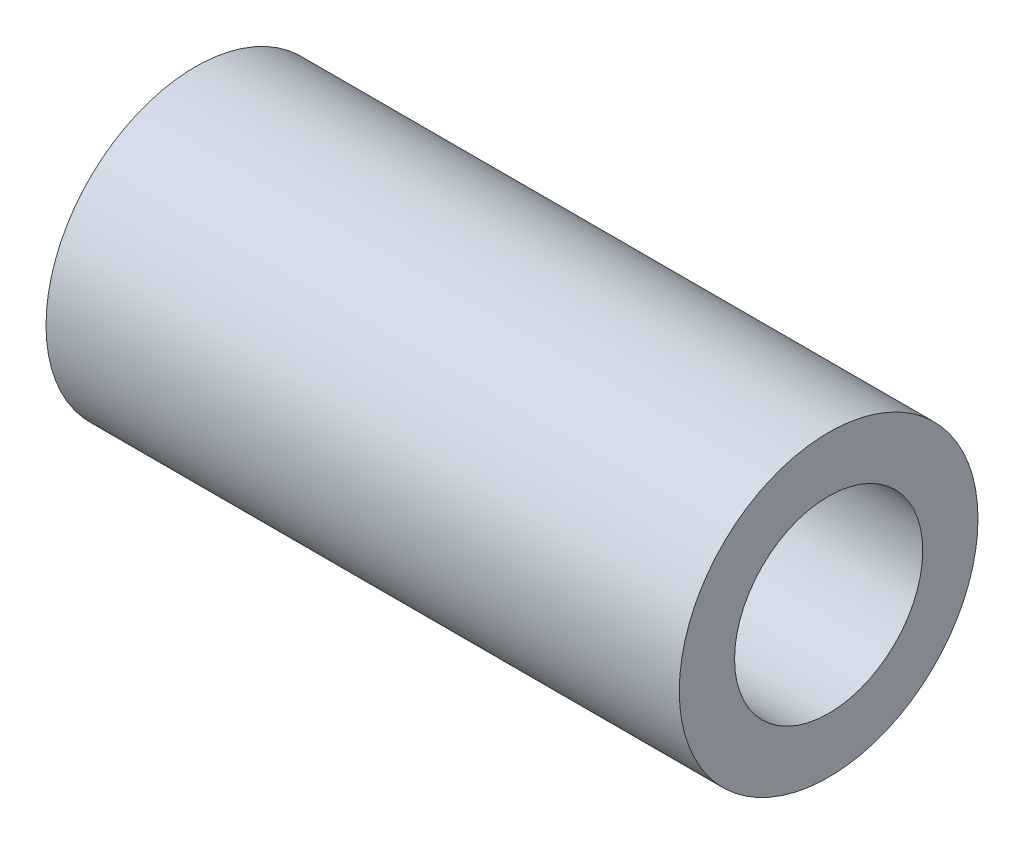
ISO-10303-21;
HEADER;
FILE_DESCRIPTION(('STEP AP214'),'2;1');
FILE_NAME('part.step','',(''),(''),'','','');
FILE_SCHEMA(('AUTOMOTIVE_DESIGN { 1 0 10303 214 1 1 1 1 }'));
ENDSEC;
DATA;
#1=APPLICATION_CONTEXT('core data for automotive mechanical design processes');
#2=APPLICATION_PROTOCOL_DEFINITION('international standard','automotive_design',2000,#1);
#3=PRODUCT_CONTEXT('',#1,'mechanical');
#4=PRODUCT('Part','Part','',(#3));
#5=PRODUCT_RELATED_PRODUCT_CATEGORY('part','',(#4));
#6=PRODUCT_DEFINITION_FORMATION('','',#4);
#7=PRODUCT_DEFINITION_CONTEXT('part definition',#1,'design');
#8=PRODUCT_DEFINITION('design','',#6,#7);
#9=PRODUCT_DEFINITION_SHAPE('','',#8);
#10=(LENGTH_UNIT() NAMED_UNIT(*) SI_UNIT(.MILLI.,.METRE.));
#11=(NAMED_UNIT(*) PLANE_ANGLE_UNIT() SI_UNIT($,.RADIAN.));
#12=(NAMED_UNIT(*) SI_UNIT($,.STERADIAN.) SOLID_ANGLE_UNIT());
#13=UNCERTAINTY_MEASURE_WITH_UNIT(LENGTH_MEASURE(1.E-05),#10,'distance_accuracy_value','');
#14=(GEOMETRIC_REPRESENTATION_CONTEXT(3) GLOBAL_UNCERTAINTY_ASSIGNED_CONTEXT((#13)) GLOBAL_UNIT_ASSIGNED_CONTEXT((#10,
#11,#12)) REPRESENTATION_CONTEXT('',''));
#15=CARTESIAN_POINT('',(0.,0.,0.));
#16=DIRECTION('',(0.,0.,1.));
#17=DIRECTION('',(1.,0.,0.));
#18=AXIS2_PLACEMENT_3D('',#15,#16,#17);
#19=CARTESIAN_POINT('',(40.386,0.,0.));
#20=DIRECTION('',(1.,0.,0.));
#21=DIRECTION('',(0.,0.,-1.));
#22=AXIS2_PLACEMENT_3D('',#19,#20,#21);
#23=PLANE('',#22);
#24=CARTESIAN_POINT('',(40.386,0.,0.));
#25=DIRECTION('',(1.,0.,0.));
#26=DIRECTION('',(0.,0.,-1.));
#27=AXIS2_PLACEMENT_3D('',#24,#25,#26);
#28=CIRCLE('',#27,9.525);
#29=CARTESIAN_POINT('',(40.386,0.,-9.525));
#30=VERTEX_POINT('',#29);
#31=EDGE_CURVE('E10',#30,#30,#28,.T.);
#32=ORIENTED_EDGE('',*,*,#31,.T.);
#33=EDGE_LOOP('',(#32));
#34=FACE_BOUND('',#33,.T.);
#35=CARTESIAN_POINT('',(40.386,0.,0.));
#36=DIRECTION('',(1.,0.,0.));
#37=DIRECTION('',(0.,0.,-1.));
#38=AXIS2_PLACEMENT_3D('',#35,#36,#37);
#39=CIRCLE('',#38,6.);
#40=CARTESIAN_POINT('',(40.386,0.,-6.));
#41=VERTEX_POINT('',#40);
#42=EDGE_CURVE('E40',#41,#41,#39,.T.);
#43=ORIENTED_EDGE('',*,*,#42,.F.);
#44=EDGE_LOOP('',(#43));
#45=FACE_BOUND('',#44,.T.);
#46=ADVANCED_FACE('F29',(#34,#45),#23,.T.);
#47=CARTESIAN_POINT('',(0.,0.,0.));
#48=DIRECTION('',(1.,0.,0.));
#49=DIRECTION('',(0.,0.,-1.));
#50=AXIS2_PLACEMENT_3D('',#47,#48,#49);
#51=PLANE('',#50);
#52=CARTESIAN_POINT('',(0.,0.,0.));
#53=DIRECTION('',(1.,0.,0.));
#54=DIRECTION('',(0.,0.,-1.));
#55=AXIS2_PLACEMENT_3D('',#52,#53,#54);
#56=CIRCLE('',#55,9.525);
#57=CARTESIAN_POINT('',(0.,0.,-9.525));
#58=VERTEX_POINT('',#57);
#59=EDGE_CURVE('E33',#58,#58,#56,.T.);
#60=ORIENTED_EDGE('',*,*,#59,.F.);
#61=EDGE_LOOP('',(#60));
#62=FACE_BOUND('',#61,.T.);
#63=CARTESIAN_POINT('',(0.,0.,0.));
#64=DIRECTION('',(1.,0.,0.));
#65=DIRECTION('',(0.,0.,-1.));
#66=AXIS2_PLACEMENT_3D('',#63,#64,#65);
#67=CIRCLE('',#66,6.);
#68=CARTESIAN_POINT('',(0.,0.,-6.));
#69=VERTEX_POINT('',#68);
#70=EDGE_CURVE('E42',#69,#69,#67,.T.);
#71=ORIENTED_EDGE('',*,*,#70,.T.);
#72=EDGE_LOOP('',(#71));
#73=FACE_BOUND('',#72,.T.);
#74=ADVANCED_FACE('F52',(#62,#73),#51,.F.);
#75=CARTESIAN_POINT('',(40.386,0.,0.));
#76=DIRECTION('',(-1.,0.,0.));
#77=DIRECTION('',(0.,0.,1.));
#78=AXIS2_PLACEMENT_3D('',#75,#76,#77);
#79=CYLINDRICAL_SURFACE('',#78,9.525);
#80=ORIENTED_EDGE('',*,*,#31,.F.);
#81=EDGE_LOOP('',(#80));
#82=FACE_BOUND('',#81,.T.);
#83=ORIENTED_EDGE('',*,*,#59,.T.);
#84=EDGE_LOOP('',(#83));
#85=FACE_BOUND('',#84,.T.);
#86=ADVANCED_FACE('F31',(#82,#85),#79,.T.);
#87=CARTESIAN_POINT('',(40.386,0.,0.));
#88=DIRECTION('',(-1.,0.,0.));
#89=DIRECTION('',(0.,0.,1.));
#90=AXIS2_PLACEMENT_3D('',#87,#88,#89);
#91=CYLINDRICAL_SURFACE('',#90,6.);
#92=ORIENTED_EDGE('',*,*,#42,.T.);
#93=EDGE_LOOP('',(#92));
#94=FACE_BOUND('',#93,.T.);
#95=ORIENTED_EDGE('',*,*,#70,.F.);
#96=EDGE_LOOP('',(#95));
#97=FACE_BOUND('',#96,.T.);
#98=ADVANCED_FACE('F48',(#94,#97),#91,.F.);
#99=CLOSED_SHELL('',(#46,#74,#86,#98));
#100=MANIFOLD_SOLID_BREP('B2',#99);
#101=ADVANCED_BREP_SHAPE_REPRESENTATION('',(#18,#100),#14);
#102=SHAPE_DEFINITION_REPRESENTATION(#9,#101);
ENDSEC;
END-ISO-10303-21;
